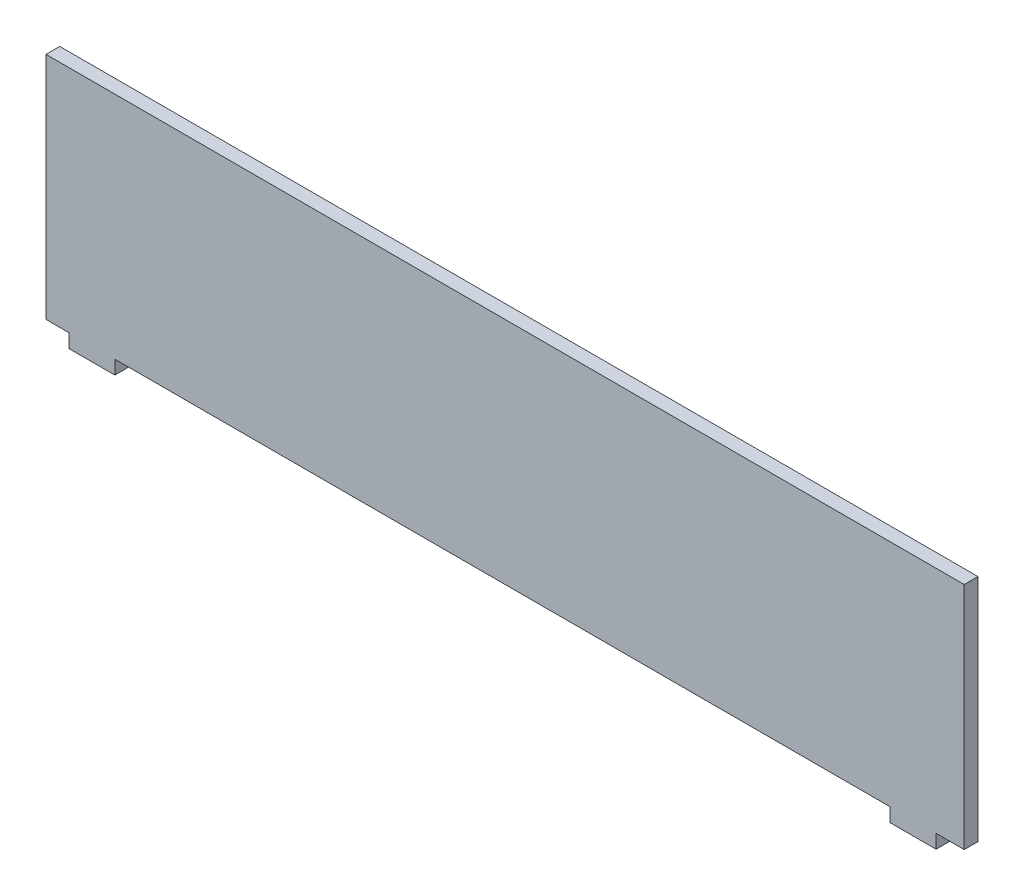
ISO-10303-21;
HEADER;
FILE_DESCRIPTION(('STEP AP214'),'2;1');
FILE_NAME('part.step','',(''),(''),'','','');
FILE_SCHEMA(('AUTOMOTIVE_DESIGN { 1 0 10303 214 1 1 1 1 }'));
ENDSEC;
DATA;
#1=APPLICATION_CONTEXT('core data for automotive mechanical design processes');
#2=APPLICATION_PROTOCOL_DEFINITION('international standard','automotive_design',2000,#1);
#3=PRODUCT_CONTEXT('',#1,'mechanical');
#4=PRODUCT('Part','Part','',(#3));
#5=PRODUCT_RELATED_PRODUCT_CATEGORY('part','',(#4));
#6=PRODUCT_DEFINITION_FORMATION('','',#4);
#7=PRODUCT_DEFINITION_CONTEXT('part definition',#1,'design');
#8=PRODUCT_DEFINITION('design','',#6,#7);
#9=PRODUCT_DEFINITION_SHAPE('','',#8);
#10=(LENGTH_UNIT() NAMED_UNIT(*) SI_UNIT(.MILLI.,.METRE.));
#11=(NAMED_UNIT(*) PLANE_ANGLE_UNIT() SI_UNIT($,.RADIAN.));
#12=(NAMED_UNIT(*) SI_UNIT($,.STERADIAN.) SOLID_ANGLE_UNIT());
#13=UNCERTAINTY_MEASURE_WITH_UNIT(LENGTH_MEASURE(1.E-05),#10,'distance_accuracy_value','');
#14=(GEOMETRIC_REPRESENTATION_CONTEXT(3) GLOBAL_UNCERTAINTY_ASSIGNED_CONTEXT((#13)) GLOBAL_UNIT_ASSIGNED_CONTEXT((#10,
#11,#12)) REPRESENTATION_CONTEXT('',''));
#15=CARTESIAN_POINT('',(0.,0.,0.));
#16=DIRECTION('',(0.,0.,1.));
#17=DIRECTION('',(1.,0.,0.));
#18=AXIS2_PLACEMENT_3D('',#15,#16,#17);
#19=CARTESIAN_POINT('',(-62.4906588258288,-16.8654181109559,3.));
#20=DIRECTION('',(1.,0.,0.));
#21=DIRECTION('',(0.,0.,-1.));
#22=AXIS2_PLACEMENT_3D('',#19,#20,#21);
#23=PLANE('',#22);
#24=DIRECTION('',(0.,-1.,0.));
#25=VECTOR('',#24,1.);
#26=CARTESIAN_POINT('',(-62.4906588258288,-16.8654181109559,0.));
#27=LINE('',#26,#25);
#28=CARTESIAN_POINT('',(-62.4906588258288,33.1345818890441,0.));
#29=VERTEX_POINT('',#28);
#30=CARTESIAN_POINT('',(-62.4906588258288,-16.8654181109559,0.));
#31=VERTEX_POINT('',#30);
#32=EDGE_CURVE('E153',#29,#31,#27,.T.);
#33=ORIENTED_EDGE('',*,*,#32,.T.);
#34=DIRECTION('',(0.,0.,-1.));
#35=VECTOR('',#34,1.);
#36=CARTESIAN_POINT('',(-62.4906588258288,-16.8654181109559,3.));
#37=LINE('',#36,#35);
#38=CARTESIAN_POINT('',(-62.4906588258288,-16.8654181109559,3.));
#39=VERTEX_POINT('',#38);
#40=EDGE_CURVE('E11',#39,#31,#37,.T.);
#41=ORIENTED_EDGE('',*,*,#40,.F.);
#42=DIRECTION('',(0.,-1.,0.));
#43=VECTOR('',#42,1.);
#44=CARTESIAN_POINT('',(-62.4906588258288,-16.8654181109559,3.));
#45=LINE('',#44,#43);
#46=CARTESIAN_POINT('',(-62.4906588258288,33.1345818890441,3.));
#47=VERTEX_POINT('',#46);
#48=EDGE_CURVE('E175',#47,#39,#45,.T.);
#49=ORIENTED_EDGE('',*,*,#48,.F.);
#50=DIRECTION('',(0.,0.,-1.));
#51=VECTOR('',#50,1.);
#52=CARTESIAN_POINT('',(-62.4906588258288,33.1345818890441,3.));
#53=LINE('',#52,#51);
#54=EDGE_CURVE('E149',#47,#29,#53,.T.);
#55=ORIENTED_EDGE('',*,*,#54,.T.);
#56=EDGE_LOOP('',(#33,#41,#49,#55));
#57=FACE_BOUND('',#56,.T.);
#58=ADVANCED_FACE('F33',(#57),#23,.F.);
#59=CARTESIAN_POINT('',(-62.4906588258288,-16.8654181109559,3.));
#60=DIRECTION('',(0.,1.,0.));
#61=DIRECTION('',(-1.,0.,0.));
#62=AXIS2_PLACEMENT_3D('',#59,#60,#61);
#63=PLANE('',#62);
#64=DIRECTION('',(1.,0.,0.));
#65=VECTOR('',#64,1.);
#66=CARTESIAN_POINT('',(-62.4906588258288,-16.8654181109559,0.));
#67=LINE('',#66,#65);
#68=CARTESIAN_POINT('',(-57.4906588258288,-16.8654181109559,0.));
#69=VERTEX_POINT('',#68);
#70=EDGE_CURVE('E156',#31,#69,#67,.T.);
#71=ORIENTED_EDGE('',*,*,#70,.T.);
#72=DIRECTION('',(0.,0.,-1.));
#73=VECTOR('',#72,1.);
#74=CARTESIAN_POINT('',(-57.4906588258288,-16.8654181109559,3.));
#75=LINE('',#74,#73);
#76=CARTESIAN_POINT('',(-57.4906588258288,-16.8654181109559,3.));
#77=VERTEX_POINT('',#76);
#78=EDGE_CURVE('E41',#77,#69,#75,.T.);
#79=ORIENTED_EDGE('',*,*,#78,.F.);
#80=DIRECTION('',(1.,0.,0.));
#81=VECTOR('',#80,1.);
#82=CARTESIAN_POINT('',(-62.4906588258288,-16.8654181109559,3.));
#83=LINE('',#82,#81);
#84=EDGE_CURVE('E104',#39,#77,#83,.T.);
#85=ORIENTED_EDGE('',*,*,#84,.F.);
#86=ORIENTED_EDGE('',*,*,#40,.T.);
#87=EDGE_LOOP('',(#71,#79,#85,#86));
#88=FACE_BOUND('',#87,.T.);
#89=ADVANCED_FACE('F253',(#88),#63,.F.);
#90=CARTESIAN_POINT('',(-57.4906588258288,-16.8654181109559,3.));
#91=DIRECTION('',(1.,0.,0.));
#92=DIRECTION('',(0.,0.,-1.));
#93=AXIS2_PLACEMENT_3D('',#90,#91,#92);
#94=PLANE('',#93);
#95=DIRECTION('',(0.,-1.,0.));
#96=VECTOR('',#95,1.);
#97=CARTESIAN_POINT('',(-57.4906588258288,-16.8654181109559,0.));
#98=LINE('',#97,#96);
#99=CARTESIAN_POINT('',(-57.4906588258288,-19.8654181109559,0.));
#100=VERTEX_POINT('',#99);
#101=EDGE_CURVE('E158',#69,#100,#98,.T.);
#102=ORIENTED_EDGE('',*,*,#101,.T.);
#103=DIRECTION('',(0.,0.,-1.));
#104=VECTOR('',#103,1.);
#105=CARTESIAN_POINT('',(-57.4906588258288,-19.8654181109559,3.));
#106=LINE('',#105,#104);
#107=CARTESIAN_POINT('',(-57.4906588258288,-19.8654181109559,3.));
#108=VERTEX_POINT('',#107);
#109=EDGE_CURVE('E194',#108,#100,#106,.T.);
#110=ORIENTED_EDGE('',*,*,#109,.F.);
#111=DIRECTION('',(0.,-1.,0.));
#112=VECTOR('',#111,1.);
#113=CARTESIAN_POINT('',(-57.4906588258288,-16.8654181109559,3.));
#114=LINE('',#113,#112);
#115=EDGE_CURVE('E202',#77,#108,#114,.T.);
#116=ORIENTED_EDGE('',*,*,#115,.F.);
#117=ORIENTED_EDGE('',*,*,#78,.T.);
#118=EDGE_LOOP('',(#102,#110,#116,#117));
#119=FACE_BOUND('',#118,.T.);
#120=ADVANCED_FACE('F200',(#119),#94,.F.);
#121=CARTESIAN_POINT('',(-57.4906588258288,-19.8654181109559,3.));
#122=DIRECTION('',(0.,1.,0.));
#123=DIRECTION('',(0.,0.,1.));
#124=AXIS2_PLACEMENT_3D('',#121,#122,#123);
#125=PLANE('',#124);
#126=DIRECTION('',(1.,0.,0.));
#127=VECTOR('',#126,1.);
#128=CARTESIAN_POINT('',(-57.4906588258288,-19.8654181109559,0.));
#129=LINE('',#128,#127);
#130=CARTESIAN_POINT('',(-47.4906588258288,-19.8654181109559,0.));
#131=VERTEX_POINT('',#130);
#132=EDGE_CURVE('E160',#100,#131,#129,.T.);
#133=ORIENTED_EDGE('',*,*,#132,.T.);
#134=DIRECTION('',(0.,0.,-1.));
#135=VECTOR('',#134,1.);
#136=CARTESIAN_POINT('',(-47.4906588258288,-19.8654181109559,3.));
#137=LINE('',#136,#135);
#138=CARTESIAN_POINT('',(-47.4906588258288,-19.8654181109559,3.));
#139=VERTEX_POINT('',#138);
#140=EDGE_CURVE('E191',#139,#131,#137,.T.);
#141=ORIENTED_EDGE('',*,*,#140,.F.);
#142=DIRECTION('',(1.,0.,0.));
#143=VECTOR('',#142,1.);
#144=CARTESIAN_POINT('',(-57.4906588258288,-19.8654181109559,3.));
#145=LINE('',#144,#143);
#146=EDGE_CURVE('E220',#108,#139,#145,.T.);
#147=ORIENTED_EDGE('',*,*,#146,.F.);
#148=ORIENTED_EDGE('',*,*,#109,.T.);
#149=EDGE_LOOP('',(#133,#141,#147,#148));
#150=FACE_BOUND('',#149,.T.);
#151=ADVANCED_FACE('F211',(#150),#125,.F.);
#152=CARTESIAN_POINT('',(-47.4906588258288,-19.8654181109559,3.));
#153=DIRECTION('',(-1.,0.,0.));
#154=DIRECTION('',(0.,-1.,0.));
#155=AXIS2_PLACEMENT_3D('',#152,#153,#154);
#156=PLANE('',#155);
#157=DIRECTION('',(0.,1.,0.));
#158=VECTOR('',#157,1.);
#159=CARTESIAN_POINT('',(-47.4906588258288,-19.8654181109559,0.));
#160=LINE('',#159,#158);
#161=CARTESIAN_POINT('',(-47.4906588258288,-16.8654181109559,0.));
#162=VERTEX_POINT('',#161);
#163=EDGE_CURVE('E162',#131,#162,#160,.T.);
#164=ORIENTED_EDGE('',*,*,#163,.T.);
#165=DIRECTION('',(0.,0.,-1.));
#166=VECTOR('',#165,1.);
#167=CARTESIAN_POINT('',(-47.4906588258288,-16.8654181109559,3.));
#168=LINE('',#167,#166);
#169=CARTESIAN_POINT('',(-47.4906588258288,-16.8654181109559,3.));
#170=VERTEX_POINT('',#169);
#171=EDGE_CURVE('E188',#170,#162,#168,.T.);
#172=ORIENTED_EDGE('',*,*,#171,.F.);
#173=DIRECTION('',(0.,1.,0.));
#174=VECTOR('',#173,1.);
#175=CARTESIAN_POINT('',(-47.4906588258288,-19.8654181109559,3.));
#176=LINE('',#175,#174);
#177=EDGE_CURVE('E217',#139,#170,#176,.T.);
#178=ORIENTED_EDGE('',*,*,#177,.F.);
#179=ORIENTED_EDGE('',*,*,#140,.T.);
#180=EDGE_LOOP('',(#164,#172,#178,#179));
#181=FACE_BOUND('',#180,.T.);
#182=ADVANCED_FACE('F215',(#181),#156,.F.);
#183=CARTESIAN_POINT('',(-47.4906588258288,-16.8654181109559,3.));
#184=DIRECTION('',(0.,1.,0.));
#185=DIRECTION('',(0.,0.,1.));
#186=AXIS2_PLACEMENT_3D('',#183,#184,#185);
#187=PLANE('',#186);
#188=DIRECTION('',(1.,0.,0.));
#189=VECTOR('',#188,1.);
#190=CARTESIAN_POINT('',(-47.4906588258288,-16.8654181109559,0.));
#191=LINE('',#190,#189);
#192=CARTESIAN_POINT('',(121.379341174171,-16.8654181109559,0.));
#193=VERTEX_POINT('',#192);
#194=EDGE_CURVE('E164',#162,#193,#191,.T.);
#195=ORIENTED_EDGE('',*,*,#194,.T.);
#196=DIRECTION('',(0.,0.,-1.));
#197=VECTOR('',#196,1.);
#198=CARTESIAN_POINT('',(121.379341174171,-16.8654181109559,3.));
#199=LINE('',#198,#197);
#200=CARTESIAN_POINT('',(121.379341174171,-16.8654181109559,3.));
#201=VERTEX_POINT('',#200);
#202=EDGE_CURVE('E185',#201,#193,#199,.T.);
#203=ORIENTED_EDGE('',*,*,#202,.F.);
#204=DIRECTION('',(1.,0.,0.));
#205=VECTOR('',#204,1.);
#206=CARTESIAN_POINT('',(-47.4906588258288,-16.8654181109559,3.));
#207=LINE('',#206,#205);
#208=EDGE_CURVE('E219',#170,#201,#207,.T.);
#209=ORIENTED_EDGE('',*,*,#208,.F.);
#210=ORIENTED_EDGE('',*,*,#171,.T.);
#211=EDGE_LOOP('',(#195,#203,#209,#210));
#212=FACE_BOUND('',#211,.T.);
#213=ADVANCED_FACE('F266',(#212),#187,.F.);
#214=CARTESIAN_POINT('',(121.379341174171,-19.8654181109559,3.));
#215=DIRECTION('',(1.,0.,0.));
#216=DIRECTION('',(0.,0.,-1.));
#217=AXIS2_PLACEMENT_3D('',#214,#215,#216);
#218=PLANE('',#217);
#219=DIRECTION('',(0.,-1.,0.));
#220=VECTOR('',#219,1.);
#221=CARTESIAN_POINT('',(121.379341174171,-19.8654181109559,0.));
#222=LINE('',#221,#220);
#223=CARTESIAN_POINT('',(121.379341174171,-19.8654181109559,0.));
#224=VERTEX_POINT('',#223);
#225=EDGE_CURVE('E166',#193,#224,#222,.T.);
#226=ORIENTED_EDGE('',*,*,#225,.T.);
#227=DIRECTION('',(0.,0.,-1.));
#228=VECTOR('',#227,1.);
#229=CARTESIAN_POINT('',(121.379341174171,-19.8654181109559,3.));
#230=LINE('',#229,#228);
#231=CARTESIAN_POINT('',(121.379341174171,-19.8654181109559,3.));
#232=VERTEX_POINT('',#231);
#233=EDGE_CURVE('E182',#232,#224,#230,.T.);
#234=ORIENTED_EDGE('',*,*,#233,.F.);
#235=DIRECTION('',(0.,-1.,0.));
#236=VECTOR('',#235,1.);
#237=CARTESIAN_POINT('',(121.379341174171,-19.8654181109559,3.));
#238=LINE('',#237,#236);
#239=EDGE_CURVE('E222',#201,#232,#238,.T.);
#240=ORIENTED_EDGE('',*,*,#239,.F.);
#241=ORIENTED_EDGE('',*,*,#202,.T.);
#242=EDGE_LOOP('',(#226,#234,#240,#241));
#243=FACE_BOUND('',#242,.T.);
#244=ADVANCED_FACE('F269',(#243),#218,.F.);
#245=CARTESIAN_POINT('',(131.379341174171,-19.8654181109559,3.));
#246=DIRECTION('',(0.,1.,0.));
#247=DIRECTION('',(0.,0.,1.));
#248=AXIS2_PLACEMENT_3D('',#245,#246,#247);
#249=PLANE('',#248);
#250=DIRECTION('',(1.,0.,0.));
#251=VECTOR('',#250,1.);
#252=CARTESIAN_POINT('',(131.379341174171,-19.8654181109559,0.));
#253=LINE('',#252,#251);
#254=CARTESIAN_POINT('',(131.379341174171,-19.8654181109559,0.));
#255=VERTEX_POINT('',#254);
#256=EDGE_CURVE('E168',#224,#255,#253,.T.);
#257=ORIENTED_EDGE('',*,*,#256,.T.);
#258=DIRECTION('',(0.,0.,-1.));
#259=VECTOR('',#258,1.);
#260=CARTESIAN_POINT('',(131.379341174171,-19.8654181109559,3.));
#261=LINE('',#260,#259);
#262=CARTESIAN_POINT('',(131.379341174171,-19.8654181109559,3.));
#263=VERTEX_POINT('',#262);
#264=EDGE_CURVE('E179',#263,#255,#261,.T.);
#265=ORIENTED_EDGE('',*,*,#264,.F.);
#266=DIRECTION('',(1.,0.,0.));
#267=VECTOR('',#266,1.);
#268=CARTESIAN_POINT('',(131.379341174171,-19.8654181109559,3.));
#269=LINE('',#268,#267);
#270=EDGE_CURVE('E228',#232,#263,#269,.T.);
#271=ORIENTED_EDGE('',*,*,#270,.F.);
#272=ORIENTED_EDGE('',*,*,#233,.T.);
#273=EDGE_LOOP('',(#257,#265,#271,#272));
#274=FACE_BOUND('',#273,.T.);
#275=ADVANCED_FACE('F234',(#274),#249,.F.);
#276=CARTESIAN_POINT('',(131.379341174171,-16.8654181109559,3.));
#277=DIRECTION('',(-1.,0.,0.));
#278=DIRECTION('',(0.,0.,1.));
#279=AXIS2_PLACEMENT_3D('',#276,#277,#278);
#280=PLANE('',#279);
#281=DIRECTION('',(0.,1.,0.));
#282=VECTOR('',#281,1.);
#283=CARTESIAN_POINT('',(131.379341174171,-16.8654181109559,0.));
#284=LINE('',#283,#282);
#285=CARTESIAN_POINT('',(131.379341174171,-16.8654181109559,0.));
#286=VERTEX_POINT('',#285);
#287=EDGE_CURVE('E170',#255,#286,#284,.T.);
#288=ORIENTED_EDGE('',*,*,#287,.T.);
#289=DIRECTION('',(0.,0.,-1.));
#290=VECTOR('',#289,1.);
#291=CARTESIAN_POINT('',(131.379341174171,-16.8654181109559,3.));
#292=LINE('',#291,#290);
#293=CARTESIAN_POINT('',(131.379341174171,-16.8654181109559,3.));
#294=VERTEX_POINT('',#293);
#295=EDGE_CURVE('E144',#294,#286,#292,.T.);
#296=ORIENTED_EDGE('',*,*,#295,.F.);
#297=DIRECTION('',(0.,1.,0.));
#298=VECTOR('',#297,1.);
#299=CARTESIAN_POINT('',(131.379341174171,-16.8654181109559,3.));
#300=LINE('',#299,#298);
#301=EDGE_CURVE('E135',#263,#294,#300,.T.);
#302=ORIENTED_EDGE('',*,*,#301,.F.);
#303=ORIENTED_EDGE('',*,*,#264,.T.);
#304=EDGE_LOOP('',(#288,#296,#302,#303));
#305=FACE_BOUND('',#304,.T.);
#306=ADVANCED_FACE('F238',(#305),#280,.F.);
#307=CARTESIAN_POINT('',(137.509341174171,-16.8654181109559,3.));
#308=DIRECTION('',(0.,1.,0.));
#309=DIRECTION('',(-1.,0.,0.));
#310=AXIS2_PLACEMENT_3D('',#307,#308,#309);
#311=PLANE('',#310);
#312=DIRECTION('',(1.,0.,0.));
#313=VECTOR('',#312,1.);
#314=CARTESIAN_POINT('',(137.509341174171,-16.8654181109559,0.));
#315=LINE('',#314,#313);
#316=CARTESIAN_POINT('',(137.509341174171,-16.8654181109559,0.));
#317=VERTEX_POINT('',#316);
#318=EDGE_CURVE('E143',#286,#317,#315,.T.);
#319=ORIENTED_EDGE('',*,*,#318,.T.);
#320=DIRECTION('',(0.,0.,-1.));
#321=VECTOR('',#320,1.);
#322=CARTESIAN_POINT('',(137.509341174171,-16.8654181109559,3.));
#323=LINE('',#322,#321);
#324=CARTESIAN_POINT('',(137.509341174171,-16.8654181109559,3.));
#325=VERTEX_POINT('',#324);
#326=EDGE_CURVE('E140',#325,#317,#323,.T.);
#327=ORIENTED_EDGE('',*,*,#326,.F.);
#328=DIRECTION('',(1.,0.,0.));
#329=VECTOR('',#328,1.);
#330=CARTESIAN_POINT('',(137.509341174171,-16.8654181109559,3.));
#331=LINE('',#330,#329);
#332=EDGE_CURVE('E129',#294,#325,#331,.T.);
#333=ORIENTED_EDGE('',*,*,#332,.F.);
#334=ORIENTED_EDGE('',*,*,#295,.T.);
#335=EDGE_LOOP('',(#319,#327,#333,#334));
#336=FACE_BOUND('',#335,.T.);
#337=ADVANCED_FACE('F141',(#336),#311,.F.);
#338=CARTESIAN_POINT('',(137.509341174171,33.1345818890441,3.));
#339=DIRECTION('',(-1.,0.,0.));
#340=DIRECTION('',(0.,0.,1.));
#341=AXIS2_PLACEMENT_3D('',#338,#339,#340);
#342=PLANE('',#341);
#343=DIRECTION('',(0.,1.,0.));
#344=VECTOR('',#343,1.);
#345=CARTESIAN_POINT('',(137.509341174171,33.1345818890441,0.));
#346=LINE('',#345,#344);
#347=CARTESIAN_POINT('',(137.509341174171,33.1345818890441,0.));
#348=VERTEX_POINT('',#347);
#349=EDGE_CURVE('E90',#317,#348,#346,.T.);
#350=ORIENTED_EDGE('',*,*,#349,.T.);
#351=DIRECTION('',(0.,0.,-1.));
#352=VECTOR('',#351,1.);
#353=CARTESIAN_POINT('',(137.509341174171,33.1345818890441,3.));
#354=LINE('',#353,#352);
#355=CARTESIAN_POINT('',(137.509341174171,33.1345818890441,3.));
#356=VERTEX_POINT('',#355);
#357=EDGE_CURVE('E145',#356,#348,#354,.T.);
#358=ORIENTED_EDGE('',*,*,#357,.F.);
#359=DIRECTION('',(0.,1.,0.));
#360=VECTOR('',#359,1.);
#361=CARTESIAN_POINT('',(137.509341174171,33.1345818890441,3.));
#362=LINE('',#361,#360);
#363=EDGE_CURVE('E133',#325,#356,#362,.T.);
#364=ORIENTED_EDGE('',*,*,#363,.F.);
#365=ORIENTED_EDGE('',*,*,#326,.T.);
#366=EDGE_LOOP('',(#350,#358,#364,#365));
#367=FACE_BOUND('',#366,.T.);
#368=ADVANCED_FACE('F147',(#367),#342,.F.);
#369=CARTESIAN_POINT('',(-62.4906588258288,33.1345818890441,3.));
#370=DIRECTION('',(0.,-1.,0.));
#371=DIRECTION('',(0.,0.,-1.));
#372=AXIS2_PLACEMENT_3D('',#369,#370,#371);
#373=PLANE('',#372);
#374=DIRECTION('',(-1.,0.,0.));
#375=VECTOR('',#374,1.);
#376=CARTESIAN_POINT('',(-62.4906588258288,33.1345818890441,0.));
#377=LINE('',#376,#375);
#378=EDGE_CURVE('E96',#348,#29,#377,.T.);
#379=ORIENTED_EDGE('',*,*,#378,.T.);
#380=ORIENTED_EDGE('',*,*,#54,.F.);
#381=DIRECTION('',(-1.,0.,0.));
#382=VECTOR('',#381,1.);
#383=CARTESIAN_POINT('',(-62.4906588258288,33.1345818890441,3.));
#384=LINE('',#383,#382);
#385=EDGE_CURVE('E49',#356,#47,#384,.T.);
#386=ORIENTED_EDGE('',*,*,#385,.F.);
#387=ORIENTED_EDGE('',*,*,#357,.T.);
#388=EDGE_LOOP('',(#379,#380,#386,#387));
#389=FACE_BOUND('',#388,.T.);
#390=ADVANCED_FACE('F242',(#389),#373,.F.);
#391=CARTESIAN_POINT('',(0.,0.,3.));
#392=DIRECTION('',(0.,0.,-1.));
#393=DIRECTION('',(-1.,0.,0.));
#394=AXIS2_PLACEMENT_3D('',#391,#392,#393);
#395=PLANE('',#394);
#396=ORIENTED_EDGE('',*,*,#48,.T.);
#397=ORIENTED_EDGE('',*,*,#84,.T.);
#398=ORIENTED_EDGE('',*,*,#115,.T.);
#399=ORIENTED_EDGE('',*,*,#146,.T.);
#400=ORIENTED_EDGE('',*,*,#177,.T.);
#401=ORIENTED_EDGE('',*,*,#208,.T.);
#402=ORIENTED_EDGE('',*,*,#239,.T.);
#403=ORIENTED_EDGE('',*,*,#270,.T.);
#404=ORIENTED_EDGE('',*,*,#301,.T.);
#405=ORIENTED_EDGE('',*,*,#332,.T.);
#406=ORIENTED_EDGE('',*,*,#363,.T.);
#407=ORIENTED_EDGE('',*,*,#385,.T.);
#408=EDGE_LOOP('',(#396,#397,#398,#399,#400,#401,#402,#403,#404,#405,#406,#407));
#409=FACE_BOUND('',#408,.T.);
#410=ADVANCED_FACE('F131',(#409),#395,.F.);
#411=CARTESIAN_POINT('',(0.,0.,0.));
#412=DIRECTION('',(0.,0.,-1.));
#413=DIRECTION('',(-1.,0.,0.));
#414=AXIS2_PLACEMENT_3D('',#411,#412,#413);
#415=PLANE('',#414);
#416=ORIENTED_EDGE('',*,*,#32,.F.);
#417=ORIENTED_EDGE('',*,*,#378,.F.);
#418=ORIENTED_EDGE('',*,*,#349,.F.);
#419=ORIENTED_EDGE('',*,*,#318,.F.);
#420=ORIENTED_EDGE('',*,*,#287,.F.);
#421=ORIENTED_EDGE('',*,*,#256,.F.);
#422=ORIENTED_EDGE('',*,*,#225,.F.);
#423=ORIENTED_EDGE('',*,*,#194,.F.);
#424=ORIENTED_EDGE('',*,*,#163,.F.);
#425=ORIENTED_EDGE('',*,*,#132,.F.);
#426=ORIENTED_EDGE('',*,*,#101,.F.);
#427=ORIENTED_EDGE('',*,*,#70,.F.);
#428=EDGE_LOOP('',(#416,#417,#418,#419,#420,#421,#422,#423,#424,#425,#426,#427));
#429=FACE_BOUND('',#428,.T.);
#430=ADVANCED_FACE('F206',(#429),#415,.T.);
#431=CLOSED_SHELL('',(#58,#89,#120,#151,#182,#213,#244,#275,#306,#337,#368,#390,#410,#430));
#432=MANIFOLD_SOLID_BREP('B2',#431);
#433=ADVANCED_BREP_SHAPE_REPRESENTATION('',(#18,#432),#14);
#434=SHAPE_DEFINITION_REPRESENTATION(#9,#433);
ENDSEC;
END-ISO-10303-21;
